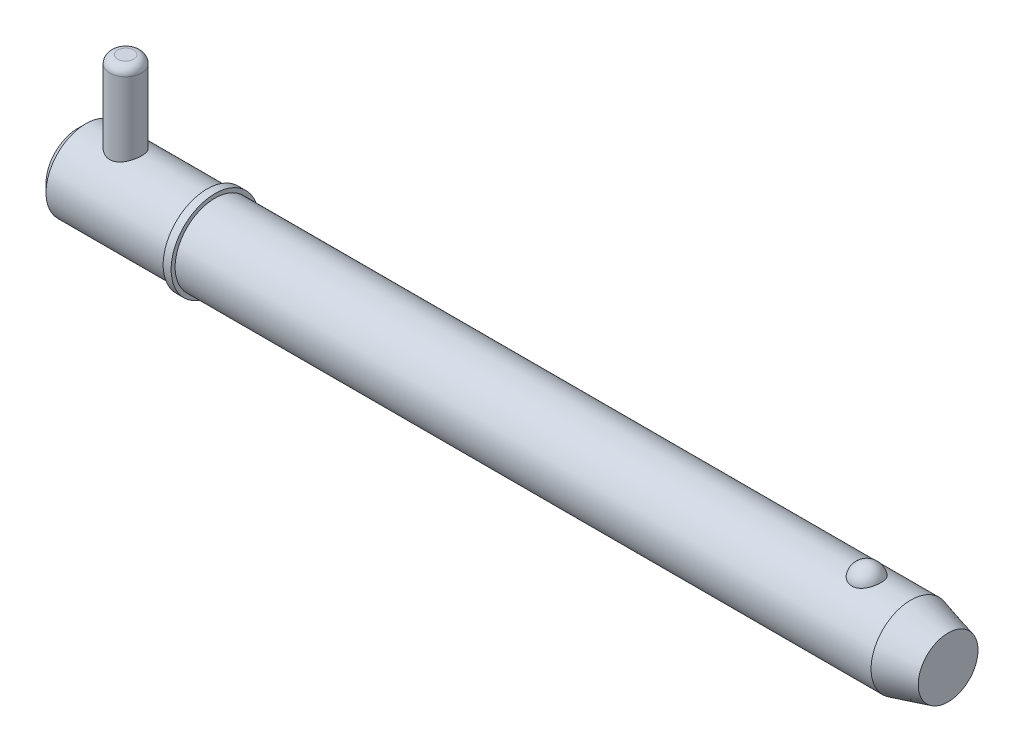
ISO-10303-21;
HEADER;
FILE_DESCRIPTION(('STEP AP214'),'2;1');
FILE_NAME('part.step','',(''),(''),'','','');
FILE_SCHEMA(('AUTOMOTIVE_DESIGN { 1 0 10303 214 1 1 1 1 }'));
ENDSEC;
DATA;
#1=APPLICATION_CONTEXT('core data for automotive mechanical design processes');
#2=APPLICATION_PROTOCOL_DEFINITION('international standard','automotive_design',2000,#1);
#3=PRODUCT_CONTEXT('',#1,'mechanical');
#4=PRODUCT('Part','Part','',(#3));
#5=PRODUCT_RELATED_PRODUCT_CATEGORY('part','',(#4));
#6=PRODUCT_DEFINITION_FORMATION('','',#4);
#7=PRODUCT_DEFINITION_CONTEXT('part definition',#1,'design');
#8=PRODUCT_DEFINITION('design','',#6,#7);
#9=PRODUCT_DEFINITION_SHAPE('','',#8);
#10=(LENGTH_UNIT() NAMED_UNIT(*) SI_UNIT(.MILLI.,.METRE.));
#11=(NAMED_UNIT(*) PLANE_ANGLE_UNIT() SI_UNIT($,.RADIAN.));
#12=(NAMED_UNIT(*) SI_UNIT($,.STERADIAN.) SOLID_ANGLE_UNIT());
#13=UNCERTAINTY_MEASURE_WITH_UNIT(LENGTH_MEASURE(1.E-05),#10,'distance_accuracy_value','');
#14=(GEOMETRIC_REPRESENTATION_CONTEXT(3) GLOBAL_UNCERTAINTY_ASSIGNED_CONTEXT((#13)) GLOBAL_UNIT_ASSIGNED_CONTEXT((#10,
#11,#12)) REPRESENTATION_CONTEXT('',''));
#15=CARTESIAN_POINT('',(0.,0.,0.));
#16=DIRECTION('',(0.,0.,1.));
#17=DIRECTION('',(1.,0.,0.));
#18=AXIS2_PLACEMENT_3D('',#15,#16,#17);
#19=CARTESIAN_POINT('',(9.525,23.81,0.));
#20=DIRECTION('',(0.,-1.,0.));
#21=DIRECTION('',(0.,0.,-1.));
#22=AXIS2_PLACEMENT_3D('',#19,#20,#21);
#23=CYLINDRICAL_SURFACE('',#22,3.175);
#24=CARTESIAN_POINT('',(9.525,-6.3525,0.));
#25=DIRECTION('',(0.,1.,0.));
#26=DIRECTION('',(0.,0.,1.));
#27=AXIS2_PLACEMENT_3D('',#24,#25,#26);
#28=CIRCLE('',#27,3.175);
#29=CARTESIAN_POINT('',(9.525,-6.3525,3.175));
#30=VERTEX_POINT('',#29);
#31=EDGE_CURVE('P0_E25',#30,#30,#28,.T.);
#32=ORIENTED_EDGE('',*,*,#31,.T.);
#33=EDGE_LOOP('',(#32));
#34=FACE_BOUND('',#33,.T.);
#35=CARTESIAN_POINT('',(9.525,22.2225,0.));
#36=DIRECTION('',(0.,1.,0.));
#37=DIRECTION('',(0.,0.,1.));
#38=AXIS2_PLACEMENT_3D('',#35,#36,#37);
#39=CIRCLE('',#38,3.175);
#40=CARTESIAN_POINT('',(9.525,22.2225,3.175));
#41=VERTEX_POINT('',#40);
#42=EDGE_CURVE('P0_E29',#41,#41,#39,.F.);
#43=ORIENTED_EDGE('',*,*,#42,.T.);
#44=EDGE_LOOP('',(#43));
#45=FACE_BOUND('',#44,.T.);
#46=ADVANCED_FACE('P0_F14',(#34,#45),#23,.T.);
#47=CARTESIAN_POINT('',(9.525,23.81,0.));
#48=DIRECTION('',(0.,1.,0.));
#49=DIRECTION('',(0.,0.,1.));
#50=AXIS2_PLACEMENT_3D('',#47,#48,#49);
#51=PLANE('',#50);
#52=CARTESIAN_POINT('',(9.525,23.81,0.));
#53=DIRECTION('',(0.,1.,0.));
#54=DIRECTION('',(0.,0.,1.));
#55=AXIS2_PLACEMENT_3D('',#52,#53,#54);
#56=CIRCLE('',#55,1.5875);
#57=CARTESIAN_POINT('',(9.525,23.81,1.5875));
#58=VERTEX_POINT('',#57);
#59=EDGE_CURVE('P0_E10',#58,#58,#56,.T.);
#60=ORIENTED_EDGE('',*,*,#59,.T.);
#61=EDGE_LOOP('',(#60));
#62=FACE_BOUND('',#61,.T.);
#63=ADVANCED_FACE('P0_F46',(#62),#51,.T.);
#64=CARTESIAN_POINT('',(9.525,-7.94,0.));
#65=DIRECTION('',(0.,1.,0.));
#66=DIRECTION('',(0.,0.,1.));
#67=AXIS2_PLACEMENT_3D('',#64,#65,#66);
#68=PLANE('',#67);
#69=CARTESIAN_POINT('',(9.525,-7.94,0.));
#70=DIRECTION('',(0.,1.,0.));
#71=DIRECTION('',(0.,0.,1.));
#72=AXIS2_PLACEMENT_3D('',#69,#70,#71);
#73=CIRCLE('',#72,1.5875);
#74=CARTESIAN_POINT('',(9.525,-7.94,1.5875));
#75=VERTEX_POINT('',#74);
#76=EDGE_CURVE('P0_E21',#75,#75,#73,.F.);
#77=ORIENTED_EDGE('',*,*,#76,.T.);
#78=EDGE_LOOP('',(#77));
#79=FACE_BOUND('',#78,.T.);
#80=ADVANCED_FACE('P0_F43',(#79),#68,.F.);
#81=CARTESIAN_POINT('',(9.525,-6.3525,0.));
#82=DIRECTION('',(0.,1.,0.));
#83=DIRECTION('',(0.,0.,1.));
#84=AXIS2_PLACEMENT_3D('',#81,#82,#83);
#85=DEGENERATE_TOROIDAL_SURFACE('',#84,1.5875,1.5875,.T.);
#86=ORIENTED_EDGE('',*,*,#76,.F.);
#87=EDGE_LOOP('',(#86));
#88=FACE_BOUND('',#87,.T.);
#89=ORIENTED_EDGE('',*,*,#31,.F.);
#90=EDGE_LOOP('',(#89));
#91=FACE_BOUND('',#90,.T.);
#92=ADVANCED_FACE('P0_F38',(#88,#91),#85,.T.);
#93=CARTESIAN_POINT('',(9.525,22.2225,0.));
#94=DIRECTION('',(0.,1.,0.));
#95=DIRECTION('',(0.,0.,1.));
#96=AXIS2_PLACEMENT_3D('',#93,#94,#95);
#97=DEGENERATE_TOROIDAL_SURFACE('',#96,1.5875,1.5875,.T.);
#98=ORIENTED_EDGE('',*,*,#42,.F.);
#99=EDGE_LOOP('',(#98));
#100=FACE_BOUND('',#99,.T.);
#101=ORIENTED_EDGE('',*,*,#59,.F.);
#102=EDGE_LOOP('',(#101));
#103=FACE_BOUND('',#102,.T.);
#104=ADVANCED_FACE('P0_F16',(#100,#103),#97,.T.);
#105=CLOSED_SHELL('',(#46,#63,#80,#92,#104));
#106=MANIFOLD_SOLID_BREP('P0_B1',#105);
#107=CARTESIAN_POINT('',(0.,0.,0.));
#108=DIRECTION('',(1.,0.,0.));
#109=DIRECTION('',(0.,0.,-1.));
#110=AXIS2_PLACEMENT_3D('',#107,#108,#109);
#111=CYLINDRICAL_SURFACE('',#110,7.94);
#112=CARTESIAN_POINT('',(165.951879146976,0.,0.));
#113=DIRECTION('',(1.,0.,0.));
#114=DIRECTION('',(0.,0.,-1.));
#115=AXIS2_PLACEMENT_3D('',#112,#113,#114);
#116=CIRCLE('',#115,7.94);
#117=CARTESIAN_POINT('',(165.951879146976,0.,-7.94));
#118=VERTEX_POINT('',#117);
#119=EDGE_CURVE('P1_E81',#118,#118,#116,.T.);
#120=ORIENTED_EDGE('',*,*,#119,.F.);
#121=EDGE_LOOP('',(#120));
#122=FACE_BOUND('',#121,.T.);
#123=CARTESIAN_POINT('',(27.31,0.,0.));
#124=DIRECTION('',(1.,0.,0.));
#125=DIRECTION('',(0.,0.,-1.));
#126=AXIS2_PLACEMENT_3D('',#123,#124,#125);
#127=CIRCLE('',#126,7.94);
#128=CARTESIAN_POINT('',(27.31,0.,-7.94));
#129=VERTEX_POINT('',#128);
#130=EDGE_CURVE('P1_E85',#129,#129,#127,.T.);
#131=ORIENTED_EDGE('',*,*,#130,.T.);
#132=EDGE_LOOP('',(#131));
#133=FACE_BOUND('',#132,.T.);
#134=CARTESIAN_POINT('',(157.144907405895,7.37767842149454,2.93486986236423));
#135=CARTESIAN_POINT('',(156.992749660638,7.3776732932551,2.93487505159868));
#136=CARTESIAN_POINT('',(156.840632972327,7.38258419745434,2.92262454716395));
#137=CARTESIAN_POINT('',(156.540928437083,7.40163229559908,2.87404196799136));
#138=CARTESIAN_POINT('',(156.393339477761,7.41576720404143,2.83771585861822));
#139=CARTESIAN_POINT('',(156.107018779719,7.45161576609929,2.74218769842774));
#140=CARTESIAN_POINT('',(155.968274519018,7.47331841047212,2.68301886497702));
#141=CARTESIAN_POINT('',(155.702882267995,7.52194082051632,2.54350967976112));
#142=CARTESIAN_POINT('',(155.576236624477,7.54886159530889,2.46316523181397));
#143=CARTESIAN_POINT('',(155.334534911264,7.60594671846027,2.28090375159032));
#144=CARTESIAN_POINT('',(155.219906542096,7.63618114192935,2.1784421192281));
#145=CARTESIAN_POINT('',(155.008878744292,7.69614046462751,1.95608495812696));
#146=CARTESIAN_POINT('',(154.912482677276,7.72586526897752,1.83618622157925));
#147=CARTESIAN_POINT('',(154.735938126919,7.78314821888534,1.57628086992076));
#148=CARTESIAN_POINT('',(154.656707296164,7.81055035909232,1.43561546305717));
#149=CARTESIAN_POINT('',(154.521797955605,7.85879631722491,1.14236334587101));
#150=CARTESIAN_POINT('',(154.466121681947,7.87963951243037,0.989775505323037));
#151=CARTESIAN_POINT('',(154.37881215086,7.91289645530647,0.674619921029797));
#152=CARTESIAN_POINT('',(154.34753090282,7.92518652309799,0.511941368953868));
#153=CARTESIAN_POINT('',(154.310975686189,7.93958930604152,0.183247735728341));
#154=CARTESIAN_POINT('',(154.305701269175,7.94170219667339,0.0172327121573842));
#155=CARTESIAN_POINT('',(154.321231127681,7.93554931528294,-0.312672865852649));
#156=CARTESIAN_POINT('',(154.341925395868,7.92732732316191,-0.476569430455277));
#157=CARTESIAN_POINT('',(154.40878655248,7.90141534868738,-0.79830524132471));
#158=CARTESIAN_POINT('',(154.454953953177,7.88372517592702,-0.956144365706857));
#159=CARTESIAN_POINT('',(154.571898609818,7.84066230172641,-1.26152073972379));
#160=CARTESIAN_POINT('',(154.642704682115,7.81528060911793,-1.40904568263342));
#161=CARTESIAN_POINT('',(154.807478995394,7.75948672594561,-1.68950598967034));
#162=CARTESIAN_POINT('',(154.901448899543,7.72907417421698,-1.82244030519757));
#163=CARTESIAN_POINT('',(155.110839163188,7.66640424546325,-2.07032792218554));
#164=CARTESIAN_POINT('',(155.226315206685,7.63414223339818,-2.18523308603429));
#165=CARTESIAN_POINT('',(155.4759006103,7.57149681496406,-2.39329737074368));
#166=CARTESIAN_POINT('',(155.610008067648,7.54111321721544,-2.48645870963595));
#167=CARTESIAN_POINT('',(155.890111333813,7.48650742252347,-2.64628132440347));
#168=CARTESIAN_POINT('',(156.035760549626,7.46215900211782,-2.71350554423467));
#169=CARTESIAN_POINT('',(156.337425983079,7.42171253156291,-2.82226614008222));
#170=CARTESIAN_POINT('',(156.493438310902,7.40561140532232,-2.86381209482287));
#171=CARTESIAN_POINT('',(156.802970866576,7.3842679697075,-2.9183907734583));
#172=CARTESIAN_POINT('',(156.956222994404,7.37852109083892,-2.93275024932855));
#173=CARTESIAN_POINT('',(157.263070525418,7.37700973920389,-2.93655208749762));
#174=CARTESIAN_POINT('',(157.416665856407,7.38124333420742,-2.92599927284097));
#175=CARTESIAN_POINT('',(157.714990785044,7.39890635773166,-2.88102897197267));
#176=CARTESIAN_POINT('',(157.859848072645,7.41205491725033,-2.84733999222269));
#177=CARTESIAN_POINT('',(158.14164329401,7.445801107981,-2.75788206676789));
#178=CARTESIAN_POINT('',(158.278580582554,7.46639934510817,-2.70211132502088));
#179=CARTESIAN_POINT('',(158.544061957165,7.51339098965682,-2.56858908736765));
#180=CARTESIAN_POINT('',(158.672354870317,7.53990200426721,-2.4903806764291));
#181=CARTESIAN_POINT('',(158.914244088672,7.59569503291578,-2.31462737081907));
#182=CARTESIAN_POINT('',(159.027837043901,7.6249776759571,-2.21707808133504));
#183=CARTESIAN_POINT('',(159.24322156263,7.68489473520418,-1.99982049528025));
#184=CARTESIAN_POINT('',(159.344148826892,7.71552419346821,-1.87925337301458));
#185=CARTESIAN_POINT('',(159.525186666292,7.77353016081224,-1.6226882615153));
#186=CARTESIAN_POINT('',(159.605293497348,7.80090608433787,-1.48668750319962));
#187=CARTESIAN_POINT('',(159.745361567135,7.85047992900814,-1.1981841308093));
#188=CARTESIAN_POINT('',(159.804587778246,7.87248183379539,-1.04529016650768));
#189=CARTESIAN_POINT('',(159.897982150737,7.90785114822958,-0.731080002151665));
#190=CARTESIAN_POINT('',(159.932149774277,7.92121837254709,-0.569763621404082));
#191=CARTESIAN_POINT('',(159.974795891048,7.93797834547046,-0.242812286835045));
#192=CARTESIAN_POINT('',(159.983204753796,7.94134405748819,-0.0771668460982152));
#193=CARTESIAN_POINT('',(159.973962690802,7.93767937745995,0.253276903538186));
#194=CARTESIAN_POINT('',(159.956312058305,7.93064910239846,0.418075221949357));
#195=CARTESIAN_POINT('',(159.895424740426,7.90695571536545,0.741525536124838));
#196=CARTESIAN_POINT('',(159.852281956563,7.8903279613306,0.900197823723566));
#197=CARTESIAN_POINT('',(159.74135358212,7.84916386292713,1.20759654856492));
#198=CARTESIAN_POINT('',(159.67356656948,7.82462706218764,1.35632241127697));
#199=CARTESIAN_POINT('',(159.514371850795,7.77006699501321,1.64032869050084));
#200=CARTESIAN_POINT('',(159.422861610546,7.74002008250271,1.7755471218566));
#201=CARTESIAN_POINT('',(159.218296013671,7.67774175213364,2.0280064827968));
#202=CARTESIAN_POINT('',(159.105241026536,7.64551037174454,2.14524772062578));
#203=CARTESIAN_POINT('',(158.860831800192,7.58265895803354,2.35778002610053));
#204=CARTESIAN_POINT('',(158.729583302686,7.5520309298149,2.45319004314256));
#205=CARTESIAN_POINT('',(158.451601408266,7.49579792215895,2.61999897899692));
#206=CARTESIAN_POINT('',(158.304867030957,7.4701932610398,2.69139637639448));
#207=CARTESIAN_POINT('',(157.992947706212,7.42622216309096,2.8105324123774));
#208=CARTESIAN_POINT('',(157.827220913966,7.40825002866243,2.85700910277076));
#209=CARTESIAN_POINT('',(157.489279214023,7.38398348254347,2.9191685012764));
#210=CARTESIAN_POINT('',(157.31706702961,7.3776842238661,2.93486399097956));
#211=CARTESIAN_POINT('',(157.144907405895,7.37767842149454,2.93486986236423));
#212=B_SPLINE_CURVE_WITH_KNOTS('',3,(#134,#135,#136,#137,#138,#139,#140,#141,#142,#143,#144,
#145,#146,#147,#148,#149,#150,#151,#152,#153,#154,#155,#156,#157,#158,#159,#160,#161,#162,#163,
#164,#165,#166,#167,#168,#169,#170,#171,#172,#173,#174,#175,#176,#177,#178,#179,#180,#181,#182,
#183,#184,#185,#186,#187,#188,#189,#190,#191,#192,#193,#194,#195,#196,#197,#198,#199,#200,#201,
#202,#203,#204,#205,#206,#207,#208,#209,#210,#211),.UNSPECIFIED.,.T.,.F.,(4,2,2,2,2,2,2,2,2,2,2,
2,2,2,2,2,2,2,2,2,2,2,2,2,2,2,2,2,2,2,2,2,2,2,2,2,2,2,4),(0.,0.455841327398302,
0.911569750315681,1.36663794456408,1.82179423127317,2.2897898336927,2.75787163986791,
3.24685368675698,3.73588214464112,4.23184282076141,4.72779494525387,5.22165321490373,
5.71552141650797,6.20996917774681,6.7044524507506,7.20023431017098,7.69596557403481,
8.18023418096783,8.66432203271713,9.12410697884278,9.58380291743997,10.0296503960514,
10.4755341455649,10.9312349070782,11.3870393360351,11.8654416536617,12.3439299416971,
12.8378875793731,13.3318558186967,13.8271581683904,14.3224549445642,14.8159385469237,
15.3094506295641,15.8051323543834,16.3008055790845,16.7937101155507,17.2866458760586,
17.8026240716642,18.3183879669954),.UNSPECIFIED.);
#213=CARTESIAN_POINT('',(157.144907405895,7.37767842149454,2.93486986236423));
#214=VERTEX_POINT('',#213);
#215=EDGE_CURVE('P1_E35',#214,#214,#212,.T.);
#216=ORIENTED_EDGE('',*,*,#215,.T.);
#217=EDGE_LOOP('',(#216));
#218=FACE_BOUND('',#217,.T.);
#219=ADVANCED_FACE('P1_F13',(#122,#133,#218),#111,.T.);
#220=CARTESIAN_POINT('',(0.,0.,0.));
#221=DIRECTION('',(-1.,0.,0.));
#222=DIRECTION('',(0.,0.,1.));
#223=AXIS2_PLACEMENT_3D('',#220,#221,#222);
#224=PLANE('',#223);
#225=CARTESIAN_POINT('',(0.,0.,0.));
#226=DIRECTION('',(1.,0.,0.));
#227=DIRECTION('',(0.,0.,-1.));
#228=AXIS2_PLACEMENT_3D('',#225,#226,#227);
#229=CIRCLE('',#228,6.352);
#230=CARTESIAN_POINT('',(0.,0.,-6.352));
#231=VERTEX_POINT('',#230);
#232=EDGE_CURVE('P1_E9',#231,#231,#229,.T.);
#233=ORIENTED_EDGE('',*,*,#232,.F.);
#234=EDGE_LOOP('',(#233));
#235=FACE_BOUND('',#234,.T.);
#236=ADVANCED_FACE('P1_F15',(#235),#224,.T.);
#237=CARTESIAN_POINT('',(1.58799999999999,0.,0.));
#238=DIRECTION('',(1.,0.,0.));
#239=DIRECTION('',(0.,0.,-1.));
#240=AXIS2_PLACEMENT_3D('',#237,#238,#239);
#241=CONICAL_SURFACE('',#240,7.94,0.78539816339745);
#242=ORIENTED_EDGE('',*,*,#232,.T.);
#243=EDGE_LOOP('',(#242));
#244=FACE_BOUND('',#243,.T.);
#245=CARTESIAN_POINT('',(1.58799999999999,0.,0.));
#246=DIRECTION('',(1.,0.,0.));
#247=DIRECTION('',(0.,0.,-1.));
#248=AXIS2_PLACEMENT_3D('',#245,#246,#247);
#249=CIRCLE('',#248,7.94);
#250=CARTESIAN_POINT('',(1.58799999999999,0.,-7.94));
#251=VERTEX_POINT('',#250);
#252=EDGE_CURVE('P1_E26',#251,#251,#249,.T.);
#253=ORIENTED_EDGE('',*,*,#252,.F.);
#254=EDGE_LOOP('',(#253));
#255=FACE_BOUND('',#254,.T.);
#256=ADVANCED_FACE('P1_F77',(#244,#255),#241,.T.);
#257=CARTESIAN_POINT('',(0.,0.,0.));
#258=DIRECTION('',(1.,0.,0.));
#259=DIRECTION('',(0.,0.,-1.));
#260=AXIS2_PLACEMENT_3D('',#257,#258,#259);
#261=CYLINDRICAL_SURFACE('',#260,7.94);
#262=CARTESIAN_POINT('',(9.525,-7.27756655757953,3.175));
#263=CARTESIAN_POINT('',(9.43992346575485,-7.27756715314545,3.17499935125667));
#264=CARTESIAN_POINT('',(9.35481882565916,-7.27906496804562,3.1715736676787));
#265=CARTESIAN_POINT('',(9.18524505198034,-7.28499816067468,3.15791803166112));
#266=CARTESIAN_POINT('',(9.100776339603,-7.28943533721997,3.14768391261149));
#267=CARTESIAN_POINT('',(8.84895715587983,-7.30698881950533,3.10684226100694));
#268=CARTESIAN_POINT('',(8.6834173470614,-7.32434654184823,3.06609574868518));
#269=CARTESIAN_POINT('',(8.36278910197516,-7.36806950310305,2.95945910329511));
#270=CARTESIAN_POINT('',(8.20766386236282,-7.39440078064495,2.89366366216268));
#271=CARTESIAN_POINT('',(7.91065319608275,-7.45304562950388,2.73907413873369));
#272=CARTESIAN_POINT('',(7.76876488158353,-7.48535789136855,2.65028508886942));
#273=CARTESIAN_POINT('',(7.49411086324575,-7.55439482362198,2.44679888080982));
#274=CARTESIAN_POINT('',(7.36219910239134,-7.59126138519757,2.33099745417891));
#275=CARTESIAN_POINT('',(7.11904234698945,-7.66408045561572,2.07909838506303));
#276=CARTESIAN_POINT('',(7.00780457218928,-7.70003264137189,1.94299368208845));
#277=CARTESIAN_POINT('',(6.80492173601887,-7.76867514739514,1.64775981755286));
#278=CARTESIAN_POINT('',(6.71422139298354,-7.80118112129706,1.48793473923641));
#279=CARTESIAN_POINT('',(6.56135788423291,-7.85754918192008,1.15376269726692));
#280=CARTESIAN_POINT('',(6.49918311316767,-7.88141478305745,0.979421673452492));
#281=CARTESIAN_POINT('',(6.40818142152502,-7.91680873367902,0.630115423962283));
#282=CARTESIAN_POINT('',(6.3778864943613,-7.9288781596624,0.455588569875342));
#283=CARTESIAN_POINT('',(6.34677743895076,-7.94127547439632,0.103539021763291));
#284=CARTESIAN_POINT('',(6.34595232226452,-7.94160773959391,-0.0739825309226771));
#285=CARTESIAN_POINT('',(6.37300128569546,-7.93082261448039,-0.416371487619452));
#286=CARTESIAN_POINT('',(6.39926693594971,-7.92034690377,-0.581389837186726));
#287=CARTESIAN_POINT('',(6.47701615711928,-7.88998770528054,-0.904449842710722));
#288=CARTESIAN_POINT('',(6.52850157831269,-7.87010352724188,-1.06249098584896));
#289=CARTESIAN_POINT('',(6.65586120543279,-7.82249343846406,-1.36995769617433));
#290=CARTESIAN_POINT('',(6.73209124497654,-7.79465387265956,-1.51921754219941));
#291=CARTESIAN_POINT('',(6.90644286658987,-7.73389606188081,-1.80321183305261));
#292=CARTESIAN_POINT('',(7.00457194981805,-7.70097607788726,-1.93794127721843));
#293=CARTESIAN_POINT('',(7.22744086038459,-7.63084889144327,-2.19843606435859));
#294=CARTESIAN_POINT('',(7.35350432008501,-7.59350211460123,-2.3230330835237));
#295=CARTESIAN_POINT('',(7.62488266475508,-7.52039654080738,-2.54979642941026));
#296=CARTESIAN_POINT('',(7.77020381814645,-7.48463826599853,-2.65195542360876));
#297=CARTESIAN_POINT('',(8.08119298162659,-7.41780943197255,-2.83361305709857));
#298=CARTESIAN_POINT('',(8.24731937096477,-7.38689959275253,-2.91239105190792));
#299=CARTESIAN_POINT('',(8.59204539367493,-7.33515216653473,-3.04038913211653));
#300=CARTESIAN_POINT('',(8.77063684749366,-7.31430804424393,-3.08962840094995));
#301=CARTESIAN_POINT('',(9.12356982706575,-7.28663831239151,-3.15431018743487));
#302=CARTESIAN_POINT('',(9.29750494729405,-7.2790344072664,-3.17163284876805));
#303=CARTESIAN_POINT('',(9.64592502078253,-7.27648884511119,-3.17747282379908));
#304=CARTESIAN_POINT('',(9.82040979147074,-7.28154335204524,-3.16599886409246));
#305=CARTESIAN_POINT('',(10.1545374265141,-7.30294638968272,-3.11628310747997));
#306=CARTESIAN_POINT('',(10.3144598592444,-7.31863587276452,-3.0796016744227));
#307=CARTESIAN_POINT('',(10.625774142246,-7.35872371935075,-2.98253618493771));
#308=CARTESIAN_POINT('',(10.7771640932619,-7.38312401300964,-2.92214687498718));
#309=CARTESIAN_POINT('',(11.0739599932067,-7.4390944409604,-2.77664664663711));
#310=CARTESIAN_POINT('',(11.2188745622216,-7.47091513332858,-2.69063278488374));
#311=CARTESIAN_POINT('',(11.4928722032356,-7.53775867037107,-2.49724834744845));
#312=CARTESIAN_POINT('',(11.6219487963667,-7.57278281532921,-2.38986907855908));
#313=CARTESIAN_POINT('',(11.8705091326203,-7.64520845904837,-2.1474449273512));
#314=CARTESIAN_POINT('',(11.9885816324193,-7.68259462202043,-2.01094304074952));
#315=CARTESIAN_POINT('',(12.2003631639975,-7.75309951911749,-1.71917041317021));
#316=CARTESIAN_POINT('',(12.2940712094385,-7.78621808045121,-1.56389891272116));
#317=CARTESIAN_POINT('',(12.4541161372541,-7.84456050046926,-1.23845027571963));
#318=CARTESIAN_POINT('',(12.5204600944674,-7.86978639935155,-1.06827700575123));
#319=CARTESIAN_POINT('',(12.6231407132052,-7.90943635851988,-0.717928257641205));
#320=CARTESIAN_POINT('',(12.6594936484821,-7.92386627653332,-0.537758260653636));
#321=CARTESIAN_POINT('',(12.6992281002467,-7.93967263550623,-0.185201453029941));
#322=CARTESIAN_POINT('',(12.7046050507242,-7.94183891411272,-0.0130732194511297));
#323=CARTESIAN_POINT('',(12.6875036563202,-7.9350072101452,0.329549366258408));
#324=CARTESIAN_POINT('',(12.6650295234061,-7.92601091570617,0.500043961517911));
#325=CARTESIAN_POINT('',(12.5942896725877,-7.89825976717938,0.829196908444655));
#326=CARTESIAN_POINT('',(12.5468364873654,-7.87981280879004,0.988057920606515));
#327=CARTESIAN_POINT('',(12.4283390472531,-7.83513565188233,1.29553461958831));
#328=CARTESIAN_POINT('',(12.3572904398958,-7.8089040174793,1.44414841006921));
#329=CARTESIAN_POINT('',(12.1900822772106,-7.7497911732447,1.73412879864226));
#330=CARTESIAN_POINT('',(12.0929519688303,-7.71666737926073,1.87488510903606));
#331=CARTESIAN_POINT('',(11.8777894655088,-7.64775894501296,2.13869231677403));
#332=CARTESIAN_POINT('',(11.7597486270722,-7.61197320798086,2.26173585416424));
#333=CARTESIAN_POINT('',(11.4974896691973,-7.53902341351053,2.49449755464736));
#334=CARTESIAN_POINT('',(11.3521039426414,-7.50191102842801,2.60292060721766));
#335=CARTESIAN_POINT('',(11.0440201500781,-7.43289551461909,2.79392602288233));
#336=CARTESIAN_POINT('',(10.8813200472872,-7.40099299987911,2.87650534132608));
#337=CARTESIAN_POINT('',(10.558064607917,-7.3489506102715,3.00682739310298));
#338=CARTESIAN_POINT('',(10.398627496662,-7.32801197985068,3.05703164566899));
#339=CARTESIAN_POINT('',(10.0731242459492,-7.29639491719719,3.13175843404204));
#340=CARTESIAN_POINT('',(9.90707793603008,-7.28568789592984,3.15635254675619));
#341=CARTESIAN_POINT('',(9.70441566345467,-7.27968826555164,3.17013149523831));
#342=CARTESIAN_POINT('',(9.66856669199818,-7.27889378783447,3.17195593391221));
#343=CARTESIAN_POINT('',(9.59681348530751,-7.27783278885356,3.17439036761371));
#344=CARTESIAN_POINT('',(9.56090924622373,-7.27756630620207,3.17500027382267));
#345=CARTESIAN_POINT('',(9.525,-7.27756655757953,3.175));
#346=B_SPLINE_CURVE_WITH_KNOTS('',3,(#262,#263,#264,#265,#266,#267,#268,#269,#270,#271,#272,
#273,#274,#275,#276,#277,#278,#279,#280,#281,#282,#283,#284,#285,#286,#287,#288,#289,#290,#291,
#292,#293,#294,#295,#296,#297,#298,#299,#300,#301,#302,#303,#304,#305,#306,#307,#308,#309,#310,
#311,#312,#313,#314,#315,#316,#317,#318,#319,#320,#321,#322,#323,#324,#325,#326,#327,#328,#329,
#330,#331,#332,#333,#334,#335,#336,#337,#338,#339,#340,#341,#342,#343,#344,#345),.UNSPECIFIED.,
.T.,.F.,(4,2,2,2,2,2,2,2,2,2,2,2,2,2,2,2,2,2,2,2,2,2,2,2,2,2,2,2,2,2,2,2,2,2,2,2,2,2,2,2,2,4),
(0.,0.255187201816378,0.510530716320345,1.0218798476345,1.53131482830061,2.04063840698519,
2.57635929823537,3.11226692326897,3.66929090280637,4.22608806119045,4.75594400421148,
5.28560237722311,5.78552836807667,6.28549104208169,6.79298787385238,7.30065880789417,
7.8416422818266,8.38280228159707,8.93923025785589,9.49529647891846,10.0174074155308,
10.5393601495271,11.0316114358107,11.5239718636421,12.0362920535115,12.5488211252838,
13.0991799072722,13.6495609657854,14.1997996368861,14.7497395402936,15.2638187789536,
15.7778202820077,16.2760504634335,16.7743726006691,17.294711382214,17.8152657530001,
18.3680208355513,18.9208410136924,19.4240423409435,19.9258334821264,20.0335354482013,
20.1412452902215),.UNSPECIFIED.);
#347=CARTESIAN_POINT('',(9.525,-7.27756655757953,3.175));
#348=VERTEX_POINT('',#347);
#349=EDGE_CURVE('P1_E17',#348,#348,#346,.T.);
#350=ORIENTED_EDGE('',*,*,#349,.F.);
#351=EDGE_LOOP('',(#350));
#352=FACE_BOUND('',#351,.T.);
#353=CARTESIAN_POINT('',(9.525,7.27756655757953,3.175));
#354=CARTESIAN_POINT('',(9.61007653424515,7.27756715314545,3.17499935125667));
#355=CARTESIAN_POINT('',(9.69518117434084,7.27906496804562,3.1715736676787));
#356=CARTESIAN_POINT('',(9.86475494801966,7.28499816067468,3.15791803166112));
#357=CARTESIAN_POINT('',(9.949223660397,7.28943533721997,3.14768391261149));
#358=CARTESIAN_POINT('',(10.2010428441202,7.30698881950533,3.10684226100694));
#359=CARTESIAN_POINT('',(10.3665826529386,7.32434654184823,3.06609574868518));
#360=CARTESIAN_POINT('',(10.6872108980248,7.36806950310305,2.95945910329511));
#361=CARTESIAN_POINT('',(10.8423361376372,7.39440078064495,2.89366366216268));
#362=CARTESIAN_POINT('',(11.1393468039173,7.45304562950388,2.73907413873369));
#363=CARTESIAN_POINT('',(11.2812351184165,7.48535789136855,2.65028508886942));
#364=CARTESIAN_POINT('',(11.5558891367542,7.55439482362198,2.44679888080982));
#365=CARTESIAN_POINT('',(11.6878008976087,7.59126138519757,2.33099745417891));
#366=CARTESIAN_POINT('',(11.9309576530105,7.66408045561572,2.07909838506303));
#367=CARTESIAN_POINT('',(12.0421954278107,7.70003264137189,1.94299368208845));
#368=CARTESIAN_POINT('',(12.2450782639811,7.76867514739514,1.64775981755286));
#369=CARTESIAN_POINT('',(12.3357786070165,7.80118112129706,1.48793473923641));
#370=CARTESIAN_POINT('',(12.4886421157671,7.85754918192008,1.15376269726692));
#371=CARTESIAN_POINT('',(12.5508168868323,7.88141478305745,0.979421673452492));
#372=CARTESIAN_POINT('',(12.641818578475,7.91680873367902,0.630115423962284));
#373=CARTESIAN_POINT('',(12.6721135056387,7.9288781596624,0.455588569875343));
#374=CARTESIAN_POINT('',(12.7032225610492,7.94127547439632,0.103539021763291));
#375=CARTESIAN_POINT('',(12.7040476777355,7.94160773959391,-0.0739825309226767));
#376=CARTESIAN_POINT('',(12.6769987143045,7.93082261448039,-0.416371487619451));
#377=CARTESIAN_POINT('',(12.6507330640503,7.92034690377,-0.581389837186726));
#378=CARTESIAN_POINT('',(12.5729838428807,7.88998770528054,-0.904449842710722));
#379=CARTESIAN_POINT('',(12.5214984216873,7.87010352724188,-1.06249098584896));
#380=CARTESIAN_POINT('',(12.3941387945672,7.82249343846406,-1.36995769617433));
#381=CARTESIAN_POINT('',(12.3179087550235,7.79465387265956,-1.51921754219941));
#382=CARTESIAN_POINT('',(12.1435571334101,7.73389606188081,-1.80321183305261));
#383=CARTESIAN_POINT('',(12.0454280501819,7.70097607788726,-1.93794127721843));
#384=CARTESIAN_POINT('',(11.8225591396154,7.63084889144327,-2.19843606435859));
#385=CARTESIAN_POINT('',(11.696495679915,7.59350211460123,-2.3230330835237));
#386=CARTESIAN_POINT('',(11.4251173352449,7.52039654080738,-2.54979642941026));
#387=CARTESIAN_POINT('',(11.2797961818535,7.48463826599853,-2.65195542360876));
#388=CARTESIAN_POINT('',(10.9688070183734,7.41780943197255,-2.83361305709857));
#389=CARTESIAN_POINT('',(10.8026806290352,7.38689959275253,-2.91239105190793));
#390=CARTESIAN_POINT('',(10.4579546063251,7.33515216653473,-3.04038913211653));
#391=CARTESIAN_POINT('',(10.2793631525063,7.31430804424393,-3.08962840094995));
#392=CARTESIAN_POINT('',(9.92643017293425,7.28663831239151,-3.15431018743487));
#393=CARTESIAN_POINT('',(9.75249505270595,7.2790344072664,-3.17163284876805));
#394=CARTESIAN_POINT('',(9.40407497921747,7.2764888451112,-3.17747282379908));
#395=CARTESIAN_POINT('',(9.22959020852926,7.28154335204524,-3.16599886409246));
#396=CARTESIAN_POINT('',(8.89546257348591,7.30294638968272,-3.11628310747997));
#397=CARTESIAN_POINT('',(8.73554014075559,7.31863587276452,-3.0796016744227));
#398=CARTESIAN_POINT('',(8.42422585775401,7.35872371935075,-2.98253618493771));
#399=CARTESIAN_POINT('',(8.27283590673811,7.38312401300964,-2.92214687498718));
#400=CARTESIAN_POINT('',(7.97604000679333,7.4390944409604,-2.77664664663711));
#401=CARTESIAN_POINT('',(7.83112543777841,7.47091513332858,-2.69063278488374));
#402=CARTESIAN_POINT('',(7.55712779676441,7.53775867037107,-2.49724834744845));
#403=CARTESIAN_POINT('',(7.42805120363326,7.57278281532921,-2.38986907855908));
#404=CARTESIAN_POINT('',(7.17949086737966,7.64520845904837,-2.1474449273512));
#405=CARTESIAN_POINT('',(7.06141836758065,7.68259462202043,-2.01094304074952));
#406=CARTESIAN_POINT('',(6.8496368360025,7.75309951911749,-1.71917041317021));
#407=CARTESIAN_POINT('',(6.75592879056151,7.78621808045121,-1.56389891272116));
#408=CARTESIAN_POINT('',(6.59588386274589,7.84456050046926,-1.23845027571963));
#409=CARTESIAN_POINT('',(6.52953990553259,7.86978639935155,-1.06827700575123));
#410=CARTESIAN_POINT('',(6.42685928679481,7.90943635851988,-0.717928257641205));
#411=CARTESIAN_POINT('',(6.39050635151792,7.92386627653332,-0.537758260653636));
#412=CARTESIAN_POINT('',(6.35077189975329,7.93967263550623,-0.18520145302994));
#413=CARTESIAN_POINT('',(6.34539494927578,7.94183891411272,-0.0130732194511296));
#414=CARTESIAN_POINT('',(6.36249634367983,7.9350072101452,0.329549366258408));
#415=CARTESIAN_POINT('',(6.38497047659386,7.92601091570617,0.500043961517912));
#416=CARTESIAN_POINT('',(6.45571032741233,7.89825976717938,0.829196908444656));
#417=CARTESIAN_POINT('',(6.50316351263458,7.87981280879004,0.988057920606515));
#418=CARTESIAN_POINT('',(6.62166095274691,7.83513565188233,1.29553461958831));
#419=CARTESIAN_POINT('',(6.69270956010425,7.8089040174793,1.44414841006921));
#420=CARTESIAN_POINT('',(6.85991772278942,7.7497911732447,1.73412879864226));
#421=CARTESIAN_POINT('',(6.95704803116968,7.71666737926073,1.87488510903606));
#422=CARTESIAN_POINT('',(7.17221053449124,7.64775894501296,2.13869231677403));
#423=CARTESIAN_POINT('',(7.29025137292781,7.61197320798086,2.26173585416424));
#424=CARTESIAN_POINT('',(7.55251033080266,7.53902341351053,2.49449755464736));
#425=CARTESIAN_POINT('',(7.69789605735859,7.50191102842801,2.60292060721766));
#426=CARTESIAN_POINT('',(8.00597984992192,7.43289551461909,2.79392602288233));
#427=CARTESIAN_POINT('',(8.16867995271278,7.40099299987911,2.87650534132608));
#428=CARTESIAN_POINT('',(8.49193539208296,7.3489506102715,3.00682739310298));
#429=CARTESIAN_POINT('',(8.65137250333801,7.32801197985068,3.05703164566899));
#430=CARTESIAN_POINT('',(8.97687575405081,7.29639491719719,3.13175843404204));
#431=CARTESIAN_POINT('',(9.14292206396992,7.28568789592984,3.15635254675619));
#432=CARTESIAN_POINT('',(9.34558433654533,7.27968826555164,3.17013149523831));
#433=CARTESIAN_POINT('',(9.38143330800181,7.27889378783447,3.17195593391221));
#434=CARTESIAN_POINT('',(9.45318651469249,7.27783278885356,3.17439036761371));
#435=CARTESIAN_POINT('',(9.48909075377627,7.27756630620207,3.17500027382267));
#436=CARTESIAN_POINT('',(9.525,7.27756655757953,3.175));
#437=B_SPLINE_CURVE_WITH_KNOTS('',3,(#353,#354,#355,#356,#357,#358,#359,#360,#361,#362,#363,
#364,#365,#366,#367,#368,#369,#370,#371,#372,#373,#374,#375,#376,#377,#378,#379,#380,#381,#382,
#383,#384,#385,#386,#387,#388,#389,#390,#391,#392,#393,#394,#395,#396,#397,#398,#399,#400,#401,
#402,#403,#404,#405,#406,#407,#408,#409,#410,#411,#412,#413,#414,#415,#416,#417,#418,#419,#420,
#421,#422,#423,#424,#425,#426,#427,#428,#429,#430,#431,#432,#433,#434,#435,#436),.UNSPECIFIED.,
.T.,.F.,(4,2,2,2,2,2,2,2,2,2,2,2,2,2,2,2,2,2,2,2,2,2,2,2,2,2,2,2,2,2,2,2,2,2,2,2,2,2,2,2,2,4),
(0.,0.255187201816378,0.510530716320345,1.0218798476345,1.53131482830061,2.04063840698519,
2.57635929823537,3.11226692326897,3.66929090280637,4.22608806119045,4.75594400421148,
5.2856023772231,5.78552836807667,6.28549104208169,6.79298787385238,7.30065880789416,
7.8416422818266,8.38280228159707,8.9392302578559,9.49529647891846,10.0174074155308,
10.5393601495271,11.0316114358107,11.5239718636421,12.0362920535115,12.5488211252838,
13.0991799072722,13.6495609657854,14.1997996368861,14.7497395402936,15.2638187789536,
15.7778202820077,16.2760504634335,16.7743726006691,17.294711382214,17.8152657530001,
18.3680208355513,18.9208410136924,19.4240423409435,19.9258334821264,20.0335354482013,
20.1412452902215),.UNSPECIFIED.);
#438=CARTESIAN_POINT('',(9.525,7.27756655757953,3.175));
#439=VERTEX_POINT('',#438);
#440=EDGE_CURVE('P1_E43',#439,#439,#437,.T.);
#441=ORIENTED_EDGE('',*,*,#440,.F.);
#442=EDGE_LOOP('',(#441));
#443=FACE_BOUND('',#442,.T.);
#444=ORIENTED_EDGE('',*,*,#252,.T.);
#445=EDGE_LOOP('',(#444));
#446=FACE_BOUND('',#445,.T.);
#447=CARTESIAN_POINT('',(25.722,0.,0.));
#448=DIRECTION('',(1.,0.,0.));
#449=DIRECTION('',(0.,0.,-1.));
#450=AXIS2_PLACEMENT_3D('',#447,#448,#449);
#451=CIRCLE('',#450,7.94);
#452=CARTESIAN_POINT('',(25.722,0.,-7.94));
#453=VERTEX_POINT('',#452);
#454=EDGE_CURVE('P1_E31',#453,#453,#451,.T.);
#455=ORIENTED_EDGE('',*,*,#454,.F.);
#456=EDGE_LOOP('',(#455));
#457=FACE_BOUND('',#456,.T.);
#458=ADVANCED_FACE('P1_F103',(#352,#443,#446,#457),#261,.T.);
#459=CARTESIAN_POINT('',(25.722,7.94,0.));
#460=DIRECTION('',(-1.,0.,0.));
#461=DIRECTION('',(0.,0.,1.));
#462=AXIS2_PLACEMENT_3D('',#459,#460,#461);
#463=PLANE('',#462);
#464=ORIENTED_EDGE('',*,*,#454,.T.);
#465=EDGE_LOOP('',(#464));
#466=FACE_BOUND('',#465,.T.);
#467=CARTESIAN_POINT('',(25.722,0.,0.));
#468=DIRECTION('',(1.,0.,0.));
#469=DIRECTION('',(0.,0.,-1.));
#470=AXIS2_PLACEMENT_3D('',#467,#468,#469);
#471=CIRCLE('',#470,8.734);
#472=CARTESIAN_POINT('',(25.722,0.,-8.734));
#473=VERTEX_POINT('',#472);
#474=EDGE_CURVE('P1_E91',#473,#473,#471,.T.);
#475=ORIENTED_EDGE('',*,*,#474,.F.);
#476=EDGE_LOOP('',(#475));
#477=FACE_BOUND('',#476,.T.);
#478=ADVANCED_FACE('P1_F100',(#466,#477),#463,.T.);
#479=CARTESIAN_POINT('',(0.,0.,0.));
#480=DIRECTION('',(1.,0.,0.));
#481=DIRECTION('',(0.,0.,-1.));
#482=AXIS2_PLACEMENT_3D('',#479,#480,#481);
#483=CYLINDRICAL_SURFACE('',#482,8.734);
#484=ORIENTED_EDGE('',*,*,#474,.T.);
#485=EDGE_LOOP('',(#484));
#486=FACE_BOUND('',#485,.T.);
#487=CARTESIAN_POINT('',(27.31,0.,0.));
#488=DIRECTION('',(1.,0.,0.));
#489=DIRECTION('',(0.,0.,-1.));
#490=AXIS2_PLACEMENT_3D('',#487,#488,#489);
#491=CIRCLE('',#490,8.734);
#492=CARTESIAN_POINT('',(27.31,0.,-8.734));
#493=VERTEX_POINT('',#492);
#494=EDGE_CURVE('P1_E88',#493,#493,#491,.T.);
#495=ORIENTED_EDGE('',*,*,#494,.F.);
#496=EDGE_LOOP('',(#495));
#497=FACE_BOUND('',#496,.T.);
#498=ADVANCED_FACE('P1_F68',(#486,#497),#483,.T.);
#499=CARTESIAN_POINT('',(27.31,8.734,0.));
#500=DIRECTION('',(1.,0.,0.));
#501=DIRECTION('',(0.,0.,-1.));
#502=AXIS2_PLACEMENT_3D('',#499,#500,#501);
#503=PLANE('',#502);
#504=ORIENTED_EDGE('',*,*,#494,.T.);
#505=EDGE_LOOP('',(#504));
#506=FACE_BOUND('',#505,.T.);
#507=ORIENTED_EDGE('',*,*,#130,.F.);
#508=EDGE_LOOP('',(#507));
#509=FACE_BOUND('',#508,.T.);
#510=ADVANCED_FACE('P1_F62',(#506,#509),#503,.T.);
#511=CARTESIAN_POINT('',(173.36,0.,0.));
#512=DIRECTION('',(-1.,0.,0.));
#513=DIRECTION('',(0.,0.,1.));
#514=AXIS2_PLACEMENT_3D('',#511,#512,#513);
#515=CONICAL_SURFACE('',#514,5.95500000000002,0.26179938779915);
#516=ORIENTED_EDGE('',*,*,#119,.T.);
#517=EDGE_LOOP('',(#516));
#518=FACE_BOUND('',#517,.T.);
#519=CARTESIAN_POINT('',(173.36,0.,0.));
#520=DIRECTION('',(1.,0.,0.));
#521=DIRECTION('',(0.,0.,-1.));
#522=AXIS2_PLACEMENT_3D('',#519,#520,#521);
#523=CIRCLE('',#522,5.95500000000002);
#524=CARTESIAN_POINT('',(173.36,0.,-5.95500000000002));
#525=VERTEX_POINT('',#524);
#526=EDGE_CURVE('P1_E42',#525,#525,#523,.T.);
#527=ORIENTED_EDGE('',*,*,#526,.F.);
#528=EDGE_LOOP('',(#527));
#529=FACE_BOUND('',#528,.T.);
#530=ADVANCED_FACE('P1_F59',(#518,#529),#515,.T.);
#531=CARTESIAN_POINT('',(173.36,5.95500000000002,0.));
#532=DIRECTION('',(1.,0.,0.));
#533=DIRECTION('',(0.,0.,-1.));
#534=AXIS2_PLACEMENT_3D('',#531,#532,#533);
#535=PLANE('',#534);
#536=ORIENTED_EDGE('',*,*,#526,.T.);
#537=EDGE_LOOP('',(#536));
#538=FACE_BOUND('',#537,.T.);
#539=ADVANCED_FACE('P1_F55',(#538),#535,.T.);
#540=CARTESIAN_POINT('',(157.144907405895,7.146,0.));
#541=DIRECTION('',(-1.,0.,0.));
#542=DIRECTION('',(0.,1.,0.));
#543=AXIS2_PLACEMENT_3D('',#540,#541,#542);
#544=SPHERICAL_SURFACE('',#543,2.944);
#545=ORIENTED_EDGE('',*,*,#215,.F.);
#546=EDGE_LOOP('',(#545));
#547=FACE_BOUND('',#546,.T.);
#548=ADVANCED_FACE('P1_F50',(#547),#544,.T.);
#549=CARTESIAN_POINT('',(9.525,-8.734,0.));
#550=DIRECTION('',(0.,1.,0.));
#551=DIRECTION('',(0.,0.,1.));
#552=AXIS2_PLACEMENT_3D('',#549,#550,#551);
#553=CYLINDRICAL_SURFACE('',#552,3.175);
#554=ORIENTED_EDGE('',*,*,#349,.T.);
#555=EDGE_LOOP('',(#554));
#556=FACE_BOUND('',#555,.T.);
#557=ORIENTED_EDGE('',*,*,#440,.T.);
#558=EDGE_LOOP('',(#557));
#559=FACE_BOUND('',#558,.T.);
#560=ADVANCED_FACE('P1_F54',(#556,#559),#553,.F.);
#561=CLOSED_SHELL('',(#219,#236,#256,#458,#478,#498,#510,#530,#539,#548,#560));
#562=MANIFOLD_SOLID_BREP('P1_B1',#561);
#563=ADVANCED_BREP_SHAPE_REPRESENTATION('',(#18,#106,#562),#14);
#564=SHAPE_DEFINITION_REPRESENTATION(#9,#563);
ENDSEC;
END-ISO-10303-21;
